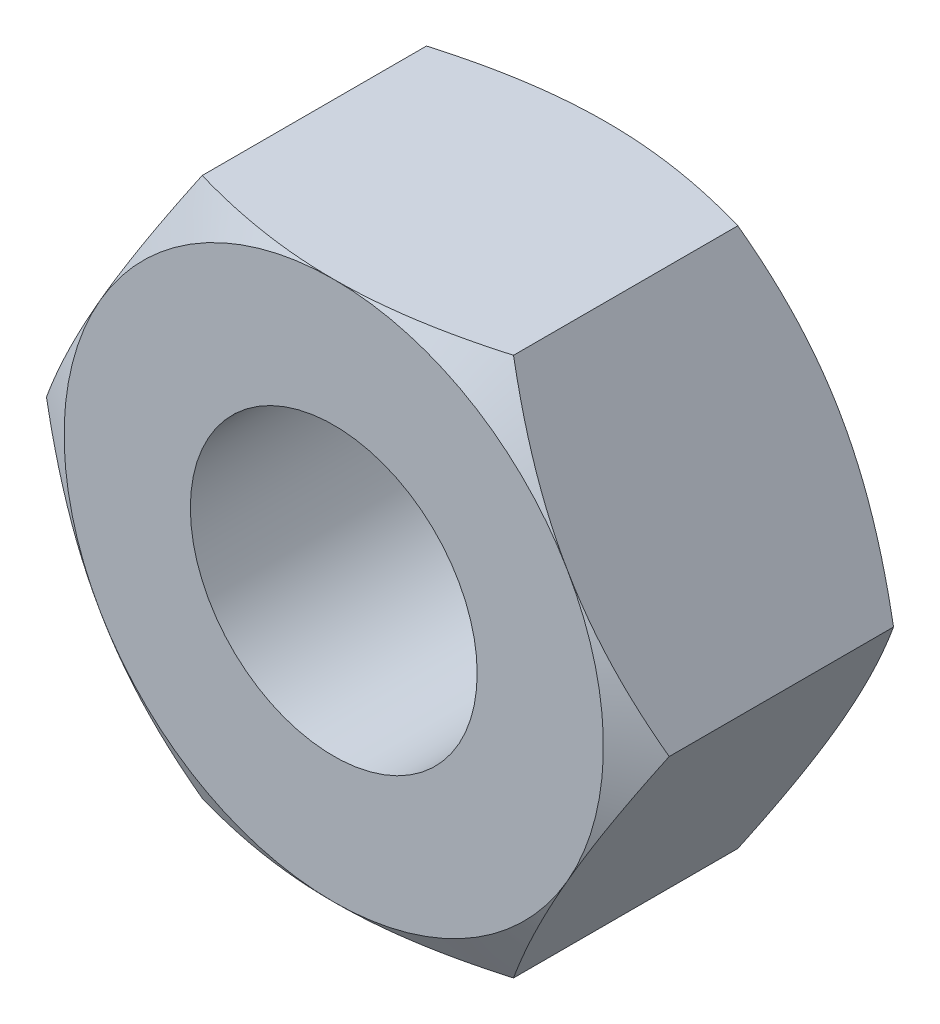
ISO-10303-21;
HEADER;
FILE_DESCRIPTION(('STEP AP214'),'2;1');
FILE_NAME('part.step','',(''),(''),'','','');
FILE_SCHEMA(('AUTOMOTIVE_DESIGN { 1 0 10303 214 1 1 1 1 }'));
ENDSEC;
DATA;
#1=APPLICATION_CONTEXT('core data for automotive mechanical design processes');
#2=APPLICATION_PROTOCOL_DEFINITION('international standard','automotive_design',2000,#1);
#3=PRODUCT_CONTEXT('',#1,'mechanical');
#4=PRODUCT('Part','Part','',(#3));
#5=PRODUCT_RELATED_PRODUCT_CATEGORY('part','',(#4));
#6=PRODUCT_DEFINITION_FORMATION('','',#4);
#7=PRODUCT_DEFINITION_CONTEXT('part definition',#1,'design');
#8=PRODUCT_DEFINITION('design','',#6,#7);
#9=PRODUCT_DEFINITION_SHAPE('','',#8);
#10=(LENGTH_UNIT() NAMED_UNIT(*) SI_UNIT(.MILLI.,.METRE.));
#11=(NAMED_UNIT(*) PLANE_ANGLE_UNIT() SI_UNIT($,.RADIAN.));
#12=(NAMED_UNIT(*) SI_UNIT($,.STERADIAN.) SOLID_ANGLE_UNIT());
#13=UNCERTAINTY_MEASURE_WITH_UNIT(LENGTH_MEASURE(1.E-05),#10,'distance_accuracy_value','');
#14=(GEOMETRIC_REPRESENTATION_CONTEXT(3) GLOBAL_UNCERTAINTY_ASSIGNED_CONTEXT((#13)) GLOBAL_UNIT_ASSIGNED_CONTEXT((#10,
#11,#12)) REPRESENTATION_CONTEXT('',''));
#15=CARTESIAN_POINT('',(0.,0.,0.));
#16=DIRECTION('',(0.,0.,1.));
#17=DIRECTION('',(1.,0.,0.));
#18=AXIS2_PLACEMENT_3D('',#15,#16,#17);
#19=CARTESIAN_POINT('',(0.,0.,-0.853596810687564));
#20=DIRECTION('',(0.,0.,-1.));
#21=DIRECTION('',(-1.,0.,0.));
#22=AXIS2_PLACEMENT_3D('',#19,#20,#21);
#23=CONICAL_SURFACE('',#22,10.9784730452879,1.0471975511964);
#24=CARTESIAN_POINT('',(-8.22724133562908,-4.75000000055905,-4.35169927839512E-13));
#25=CARTESIAN_POINT('',(-8.34364141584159,-4.5483891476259,3.88261547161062E-05));
#26=CARTESIAN_POINT('',(-8.46003588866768,-4.34678800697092,-0.00493960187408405));
#27=CARTESIAN_POINT('',(-8.69259629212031,-3.94398157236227,-0.0246423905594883));
#28=CARTESIAN_POINT('',(-8.80876226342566,-3.74277620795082,-0.0393648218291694));
#29=CARTESIAN_POINT('',(-9.0401153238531,-3.34206095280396,-0.0781700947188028));
#30=CARTESIAN_POINT('',(-9.15530440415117,-3.14254761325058,-0.102205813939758));
#31=CARTESIAN_POINT('',(-9.38513376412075,-2.74447148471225,-0.159120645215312));
#32=CARTESIAN_POINT('',(-9.49977402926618,-2.54590872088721,-0.19199999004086));
#33=CARTESIAN_POINT('',(-9.84239640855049,-1.95246935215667,-0.302887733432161));
#34=CARTESIAN_POINT('',(-10.0693831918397,-1.55931671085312,-0.393199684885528));
#35=CARTESIAN_POINT('',(-10.5214047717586,-0.776392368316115,-0.601482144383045));
#36=CARTESIAN_POINT('',(-10.7464238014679,-0.386647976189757,-0.719590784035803));
#37=CARTESIAN_POINT('',(-10.969655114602,-1.11143325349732E-12,-0.848505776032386));
#38=B_SPLINE_CURVE_WITH_KNOTS('',3,(#24,#25,#26,#27,#28,#29,#30,#31,#32,#33,#34,#35,#36,#37),
.UNSPECIFIED.,.F.,.F.,(4,2,2,2,2,2,4),(0.,0.698329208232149,1.39652018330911,2.09122370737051,
2.78594551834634,4.173568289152,5.56823794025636),.UNSPECIFIED.);
#39=CARTESIAN_POINT('',(-8.22724133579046,-4.75000000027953,-3.6097070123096E-13));
#40=VERTEX_POINT('',#39);
#41=CARTESIAN_POINT('',(-10.9696551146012,-8.78443786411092E-13,-0.848505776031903));
#42=VERTEX_POINT('',#41);
#43=EDGE_CURVE('E316',#40,#42,#38,.T.);
#44=ORIENTED_EDGE('',*,*,#43,.F.);
#45=CARTESIAN_POINT('',(0.,0.,-2.86771474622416E-13));
#46=DIRECTION('',(0.,0.,-1.));
#47=DIRECTION('',(-1.,0.,0.));
#48=AXIS2_PLACEMENT_3D('',#45,#46,#47);
#49=CIRCLE('',#48,9.49999999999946);
#50=CARTESIAN_POINT('',(-8.22724142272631,4.74999984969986,-4.19934956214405E-13));
#51=VERTEX_POINT('',#50);
#52=EDGE_CURVE('E152',#40,#51,#49,.T.);
#53=ORIENTED_EDGE('',*,*,#52,.T.);
#54=CARTESIAN_POINT('',(-10.9696551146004,-6.45071824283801E-13,-0.848505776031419));
#55=CARTESIAN_POINT('',(-10.7464238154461,0.386647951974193,-0.719590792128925));
#56=CARTESIAN_POINT('',(-10.5214047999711,0.776392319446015,-0.601482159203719));
#57=CARTESIAN_POINT('',(-10.0693832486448,1.55931661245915,-0.393199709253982));
#58=CARTESIAN_POINT('',(-9.84239647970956,1.95246922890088,-0.302887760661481));
#59=CARTESIAN_POINT('',(-9.49977412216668,2.54590855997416,-0.192000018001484));
#60=CARTESIAN_POINT('',(-9.38513386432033,2.74447131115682,-0.159120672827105));
#61=CARTESIAN_POINT('',(-9.15530451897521,3.14254741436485,-0.102205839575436));
#62=CARTESIAN_POINT('',(-9.04011544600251,3.34206074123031,-0.0781701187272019));
#63=CARTESIAN_POINT('',(-8.80876240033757,3.74277597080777,-0.0393648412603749));
#64=CARTESIAN_POINT('',(-8.69259643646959,3.94398132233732,-0.0246424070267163));
#65=CARTESIAN_POINT('',(-8.46003604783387,4.34678773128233,-0.00493961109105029));
#66=CARTESIAN_POINT('',(-8.34364158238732,4.54838885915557,3.8821224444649E-05));
#67=CARTESIAN_POINT('',(-8.2272415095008,4.74999969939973,9.0612996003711E-13));
#68=B_SPLINE_CURVE_WITH_KNOTS('',3,(#54,#55,#56,#57,#58,#59,#60,#61,#62,#63,#64,#65,#66,#67),
.UNSPECIFIED.,.F.,.F.,(4,2,2,2,2,2,4),(0.,1.39466956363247,2.78229224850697,3.47701401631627,
4.1717174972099,4.86990842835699,5.5682375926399),.UNSPECIFIED.);
#69=EDGE_CURVE('E158',#42,#51,#68,.T.);
#70=ORIENTED_EDGE('',*,*,#69,.F.);
#71=EDGE_LOOP('',(#44,#53,#70));
#72=FACE_BOUND('',#71,.T.);
#73=ADVANCED_FACE('F41',(#72),#23,.T.);
#74=CARTESIAN_POINT('',(0.,0.,-0.853596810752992));
#75=DIRECTION('',(0.,0.,-1.));
#76=DIRECTION('',(0.,1.,0.));
#77=AXIS2_PLACEMENT_3D('',#74,#75,#76);
#78=CONICAL_SURFACE('',#77,10.9784730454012,1.0471975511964);
#79=CARTESIAN_POINT('',(-8.2272415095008,4.74999969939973,9.0612778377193E-13));
#80=CARTESIAN_POINT('',(-8.11084142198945,4.95161056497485,3.88310693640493E-05));
#81=CARTESIAN_POINT('',(-7.99444694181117,5.15321171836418,-0.00493959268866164));
#82=CARTESIAN_POINT('',(-7.76188652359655,5.55601817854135,-0.024642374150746));
#83=CARTESIAN_POINT('',(-7.6457205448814,5.75722355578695,-0.0393648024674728));
#84=CARTESIAN_POINT('',(-7.41436746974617,6.15793883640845,-0.0781700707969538));
#85=CARTESIAN_POINT('',(-7.29917838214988,6.35745218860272,-0.1022057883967));
#86=CARTESIAN_POINT('',(-7.06934900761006,6.75552834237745,-0.159120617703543));
#87=CARTESIAN_POINT('',(-6.9547087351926,6.95409111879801,-0.191999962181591));
#88=CARTESIAN_POINT('',(-6.61208633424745,7.54753052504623,-0.302887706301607));
#89=CARTESIAN_POINT('',(-6.38509953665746,7.94068319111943,-0.393199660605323));
#90=CARTESIAN_POINT('',(-5.93307792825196,8.72360758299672,-0.6014821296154));
#91=CARTESIAN_POINT('',(-5.70805888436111,9.11335199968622,-0.719590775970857));
#92=CARTESIAN_POINT('',(-5.48482755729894,9.49999999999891,-0.848505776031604));
#93=B_SPLINE_CURVE_WITH_KNOTS('',3,(#79,#80,#81,#82,#83,#84,#85,#86,#87,#88,#89,#90,#91,#92),
.UNSPECIFIED.,.F.,.F.,(4,2,2,2,2,2,4),(0.,0.698329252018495,1.39652027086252,2.09122383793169,
2.78594569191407,4.17356854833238,5.56823828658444),.UNSPECIFIED.);
#94=CARTESIAN_POINT('',(-5.48482755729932,9.49999999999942,-0.848505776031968));
#95=VERTEX_POINT('',#94);
#96=EDGE_CURVE('E137',#51,#95,#93,.T.);
#97=ORIENTED_EDGE('',*,*,#96,.F.);
#98=CARTESIAN_POINT('',(0.,0.,-4.19911501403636E-13));
#99=DIRECTION('',(0.,0.,-1.));
#100=DIRECTION('',(0.,1.,0.));
#101=AXIS2_PLACEMENT_3D('',#98,#99,#100);
#102=CIRCLE('',#101,9.49999999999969);
#103=CARTESIAN_POINT('',(0.,9.49999999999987,-5.21512884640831E-13));
#104=VERTEX_POINT('',#103);
#105=EDGE_CURVE('E139',#51,#104,#102,.T.);
#106=ORIENTED_EDGE('',*,*,#105,.T.);
#107=CARTESIAN_POINT('',(-5.48482755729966,9.5,-0.848505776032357));
#108=CARTESIAN_POINT('',(-5.03836493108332,9.5,-0.719590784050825));
#109=CARTESIAN_POINT('',(-4.58832687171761,9.5,-0.601482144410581));
#110=CARTESIAN_POINT('',(-3.68428371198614,9.5,-0.393199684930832));
#111=CARTESIAN_POINT('',(-3.23031014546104,9.5,-0.302887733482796));
#112=CARTESIAN_POINT('',(-2.54506538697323,9.5,-0.191999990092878));
#113=CARTESIAN_POINT('',(-2.3157848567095,9.5,-0.159120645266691));
#114=CARTESIAN_POINT('',(-1.8561261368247,9.5,-0.102205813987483));
#115=CARTESIAN_POINT('',(-1.62574797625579,9.5,-0.0781700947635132));
#116=CARTESIAN_POINT('',(-1.16304185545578,9.5,-0.039364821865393));
#117=CARTESIAN_POINT('',(-0.930709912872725,9.5,-0.0246423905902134));
#118=CARTESIAN_POINT('',(-0.465589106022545,9.5,-0.00493960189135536));
#119=CARTESIAN_POINT('',(-0.23280016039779,9.5,3.88261454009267E-05));
#120=CARTESIAN_POINT('',(0.,9.5,-5.96174655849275E-13));
#121=B_SPLINE_CURVE_WITH_KNOTS('',3,(#107,#108,#109,#110,#111,#112,#113,#114,#115,#116,#117,
#118,#119,#120),.UNSPECIFIED.,.F.,.F.,(4,2,2,2,2,2,4),(0.,1.39466965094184,2.78229242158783,
3.47701423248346,4.17171775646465,4.86990873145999,5.56823793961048),.UNSPECIFIED.);
#122=EDGE_CURVE('E45',#95,#104,#121,.T.);
#123=ORIENTED_EDGE('',*,*,#122,.F.);
#124=EDGE_LOOP('',(#97,#106,#123));
#125=FACE_BOUND('',#124,.T.);
#126=ADVANCED_FACE('F135',(#125),#78,.T.);
#127=CARTESIAN_POINT('',(0.,0.,-0.853596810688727));
#128=DIRECTION('',(0.,0.,-1.));
#129=DIRECTION('',(0.,1.,0.));
#130=AXIS2_PLACEMENT_3D('',#127,#128,#129);
#131=CONICAL_SURFACE('',#130,10.9784730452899,1.0471975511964);
#132=CARTESIAN_POINT('',(0.,9.5,-5.96195917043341E-13));
#133=CARTESIAN_POINT('',(0.232800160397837,9.5,3.88261454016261E-05));
#134=CARTESIAN_POINT('',(0.465589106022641,9.5,-0.00493960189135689));
#135=CARTESIAN_POINT('',(0.930709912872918,9.5,-0.0246423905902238));
#136=CARTESIAN_POINT('',(1.16304185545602,9.5,-0.0393648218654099));
#137=CARTESIAN_POINT('',(1.62574797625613,9.5,-0.0781700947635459));
#138=CARTESIAN_POINT('',(1.85612613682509,9.5,-0.102205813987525));
#139=CARTESIAN_POINT('',(2.31578485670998,9.5,-0.159120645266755));
#140=CARTESIAN_POINT('',(2.54506538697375,9.5,-0.191999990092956));
#141=CARTESIAN_POINT('',(3.23031014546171,9.5,-0.302887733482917));
#142=CARTESIAN_POINT('',(3.6842837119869,9.5,-0.393199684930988));
#143=CARTESIAN_POINT('',(4.58832687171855,9.5,-0.601482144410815));
#144=CARTESIAN_POINT('',(5.03836493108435,9.5,-0.719590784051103));
#145=CARTESIAN_POINT('',(5.48482755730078,9.5,-0.848505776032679));
#146=B_SPLINE_CURVE_WITH_KNOTS('',3,(#132,#133,#134,#135,#136,#137,#138,#139,#140,#141,#142,
#143,#144,#145),.UNSPECIFIED.,.F.,.F.,(4,2,2,2,2,2,4),(0.,0.698329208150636,1.39652018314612,
2.09122370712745,2.78594551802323,4.17356828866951,5.56823793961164),.UNSPECIFIED.);
#147=CARTESIAN_POINT('',(5.48482755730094,9.4999999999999,-0.848505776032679));
#148=VERTEX_POINT('',#147);
#149=EDGE_CURVE('E142',#104,#148,#146,.T.);
#150=ORIENTED_EDGE('',*,*,#149,.F.);
#151=CARTESIAN_POINT('',(0.,0.,-4.46908135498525E-13));
#152=DIRECTION('',(0.,0.,-1.));
#153=DIRECTION('',(0.,1.,0.));
#154=AXIS2_PLACEMENT_3D('',#151,#152,#153);
#155=CIRCLE('',#154,9.49999999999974);
#156=CARTESIAN_POINT('',(8.22724133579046,4.75000000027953,-3.60851372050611E-13));
#157=VERTEX_POINT('',#156);
#158=EDGE_CURVE('E405',#104,#157,#155,.T.);
#159=ORIENTED_EDGE('',*,*,#158,.T.);
#160=CARTESIAN_POINT('',(5.48482755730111,9.4999999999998,-0.848505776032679));
#161=CARTESIAN_POINT('',(5.7080588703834,9.11335202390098,-0.719590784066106));
#162=CARTESIAN_POINT('',(5.9330779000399,8.72360763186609,-0.601482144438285));
#163=CARTESIAN_POINT('',(6.38509947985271,7.94068328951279,-0.393199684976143));
#164=CARTESIAN_POINT('',(6.61208626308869,7.54753064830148,-0.302887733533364));
#165=CARTESIAN_POINT('',(6.95470864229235,6.95409127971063,-0.191999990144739));
#166=CARTESIAN_POINT('',(7.0693489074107,6.75552851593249,-0.159120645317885));
#167=CARTESIAN_POINT('',(7.29917826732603,6.35745238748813,-0.102205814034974));
#168=CARTESIAN_POINT('',(7.41436734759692,6.15793904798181,-0.078170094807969));
#169=CARTESIAN_POINT('',(7.64572040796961,5.7572237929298,-0.039364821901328));
#170=CARTESIAN_POINT('',(7.76188637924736,5.55601842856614,-0.0246423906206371));
#171=CARTESIAN_POINT('',(7.99444678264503,5.15321199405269,-0.0049396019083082));
#172=CARTESIAN_POINT('',(8.11084125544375,4.95161085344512,3.88261364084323E-05));
#173=CARTESIAN_POINT('',(8.22724133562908,4.75000000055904,-4.34557466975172E-13));
#174=B_SPLINE_CURVE_WITH_KNOTS('',3,(#160,#161,#162,#163,#164,#165,#166,#167,#168,#169,#170,
#171,#172,#173),.UNSPECIFIED.,.F.,.F.,(4,2,2,2,2,2,4),(0.,1.39466965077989,2.78229242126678,
3.47701423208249,4.17171775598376,4.86990873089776,5.56823793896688),.UNSPECIFIED.);
#175=EDGE_CURVE('E197',#148,#157,#174,.T.);
#176=ORIENTED_EDGE('',*,*,#175,.F.);
#177=EDGE_LOOP('',(#150,#159,#176));
#178=FACE_BOUND('',#177,.T.);
#179=ADVANCED_FACE('F186',(#178),#131,.T.);
#180=CARTESIAN_POINT('',(0.,0.,-0.853596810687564));
#181=DIRECTION('',(0.,0.,-1.));
#182=DIRECTION('',(-1.,0.,0.));
#183=AXIS2_PLACEMENT_3D('',#180,#181,#182);
#184=CONICAL_SURFACE('',#183,10.9784730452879,1.0471975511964);
#185=CARTESIAN_POINT('',(8.22724133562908,4.75000000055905,-4.34931269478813E-13));
#186=CARTESIAN_POINT('',(8.34364141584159,4.5483891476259,3.88261547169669E-05));
#187=CARTESIAN_POINT('',(8.46003588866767,4.34678800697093,-0.00493960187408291));
#188=CARTESIAN_POINT('',(8.69259629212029,3.94398157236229,-0.0246423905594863));
#189=CARTESIAN_POINT('',(8.80876226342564,3.74277620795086,-0.0393648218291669));
#190=CARTESIAN_POINT('',(9.04011532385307,3.34206095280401,-0.0781700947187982));
#191=CARTESIAN_POINT('',(9.15530440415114,3.14254761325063,-0.102205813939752));
#192=CARTESIAN_POINT('',(9.38513376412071,2.74447148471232,-0.159120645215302));
#193=CARTESIAN_POINT('',(9.49977402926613,2.54590872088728,-0.191999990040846));
#194=CARTESIAN_POINT('',(9.84239640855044,1.95246935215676,-0.302887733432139));
#195=CARTESIAN_POINT('',(10.0693831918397,1.55931671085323,-0.393199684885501));
#196=CARTESIAN_POINT('',(10.5214047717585,0.776392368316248,-0.601482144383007));
#197=CARTESIAN_POINT('',(10.7464238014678,0.386647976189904,-0.719590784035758));
#198=CARTESIAN_POINT('',(10.969655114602,1.27333752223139E-12,-0.848505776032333));
#199=B_SPLINE_CURVE_WITH_KNOTS('',3,(#185,#186,#187,#188,#189,#190,#191,#192,#193,#194,#195,
#196,#197,#198),.UNSPECIFIED.,.F.,.F.,(4,2,2,2,2,2,4),(0.,0.698329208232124,1.39652018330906,
2.09122370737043,2.78594551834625,4.17356828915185,5.56823794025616),.UNSPECIFIED.);
#200=CARTESIAN_POINT('',(10.9696551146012,1.03954200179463E-12,-0.848505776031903));
#201=VERTEX_POINT('',#200);
#202=EDGE_CURVE('E403',#157,#201,#199,.T.);
#203=ORIENTED_EDGE('',*,*,#202,.F.);
#204=CARTESIAN_POINT('',(0.,0.,-2.86771474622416E-13));
#205=DIRECTION('',(0.,0.,-1.));
#206=DIRECTION('',(-1.,0.,0.));
#207=AXIS2_PLACEMENT_3D('',#204,#205,#206);
#208=CIRCLE('',#207,9.49999999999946);
#209=CARTESIAN_POINT('',(8.22724133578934,-4.75000000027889,-2.86705537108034E-13));
#210=VERTEX_POINT('',#209);
#211=EDGE_CURVE('E394',#157,#210,#208,.T.);
#212=ORIENTED_EDGE('',*,*,#211,.T.);
#213=CARTESIAN_POINT('',(10.9696551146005,8.06281182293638E-13,-0.848505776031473));
#214=CARTESIAN_POINT('',(10.7464238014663,-0.386647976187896,-0.719590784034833));
#215=CARTESIAN_POINT('',(10.5214047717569,-0.776392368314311,-0.601482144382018));
#216=CARTESIAN_POINT('',(10.069383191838,-1.55931671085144,-0.393199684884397));
#217=CARTESIAN_POINT('',(9.84239640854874,-1.95246935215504,-0.302887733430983));
#218=CARTESIAN_POINT('',(9.49977402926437,-2.54590872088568,-0.191999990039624));
#219=CARTESIAN_POINT('',(9.38513376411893,-2.74447148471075,-0.159120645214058));
#220=CARTESIAN_POINT('',(9.15530440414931,-3.14254761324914,-0.102205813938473));
#221=CARTESIAN_POINT('',(9.04011532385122,-3.34206095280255,-0.0781700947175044));
#222=CARTESIAN_POINT('',(8.80876226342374,-3.74277620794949,-0.0393648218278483));
#223=CARTESIAN_POINT('',(8.69259629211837,-3.94398157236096,-0.0246423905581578));
#224=CARTESIAN_POINT('',(8.4600358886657,-4.34678800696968,-0.0049396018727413));
#225=CARTESIAN_POINT('',(8.34364141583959,-4.54838914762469,3.8826156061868E-05));
#226=CARTESIAN_POINT('',(8.22724133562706,-4.75000000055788,9.09340811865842E-13));
#227=B_SPLINE_CURVE_WITH_KNOTS('',3,(#213,#214,#215,#216,#217,#218,#219,#220,#221,#222,#223,
#224,#225,#226),.UNSPECIFIED.,.F.,.F.,(4,2,2,2,2,2,4),(0.,1.3946696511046,2.78229242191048,
3.47701423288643,4.17171775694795,4.86990873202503,5.5682379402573),.UNSPECIFIED.);
#228=EDGE_CURVE('E363',#201,#210,#227,.T.);
#229=ORIENTED_EDGE('',*,*,#228,.F.);
#230=EDGE_LOOP('',(#203,#212,#229));
#231=FACE_BOUND('',#230,.T.);
#232=ADVANCED_FACE('F191',(#231),#184,.T.);
#233=CARTESIAN_POINT('',(0.,0.,-0.853596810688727));
#234=DIRECTION('',(0.,0.,-1.));
#235=DIRECTION('',(0.,1.,0.));
#236=AXIS2_PLACEMENT_3D('',#233,#234,#235);
#237=CONICAL_SURFACE('',#236,10.9784730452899,1.0471975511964);
#238=CARTESIAN_POINT('',(8.22724133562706,-4.75000000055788,9.09901372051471E-13));
#239=CARTESIAN_POINT('',(8.11084125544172,-4.95161085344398,3.88261377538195E-05));
#240=CARTESIAN_POINT('',(7.99444678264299,-5.15321199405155,-0.00493960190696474));
#241=CARTESIAN_POINT('',(7.76188637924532,-5.55601842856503,-0.0246423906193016));
#242=CARTESIAN_POINT('',(7.64572040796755,-5.7572237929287,-0.0393648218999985));
#243=CARTESIAN_POINT('',(7.41436734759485,-6.15793904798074,-0.078170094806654));
#244=CARTESIAN_POINT('',(7.29917826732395,-6.35745238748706,-0.102205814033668));
#245=CARTESIAN_POINT('',(7.06934890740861,-6.75552851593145,-0.159120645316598));
#246=CARTESIAN_POINT('',(6.95470864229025,-6.9540912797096,-0.191999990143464));
#247=CARTESIAN_POINT('',(6.61208626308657,-7.54753064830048,-0.302887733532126));
#248=CARTESIAN_POINT('',(6.38509947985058,-7.94068328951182,-0.393199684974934));
#249=CARTESIAN_POINT('',(5.93307790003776,-8.72360763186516,-0.60148214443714));
#250=CARTESIAN_POINT('',(5.70805887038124,-9.11335202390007,-0.719590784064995));
#251=CARTESIAN_POINT('',(5.48482755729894,-9.49999999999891,-0.848505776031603));
#252=B_SPLINE_CURVE_WITH_KNOTS('',3,(#238,#239,#240,#241,#242,#243,#244,#245,#246,#247,#248,
#249,#250,#251),.UNSPECIFIED.,.F.,.F.,(4,2,2,2,2,2,4),(0.,0.698329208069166,1.39652018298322,
2.09122370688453,2.78594551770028,4.17356828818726,5.56823793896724),.UNSPECIFIED.);
#253=CARTESIAN_POINT('',(5.48482755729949,-9.49999999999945,-0.848505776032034));
#254=VERTEX_POINT('',#253);
#255=EDGE_CURVE('E355',#210,#254,#252,.T.);
#256=ORIENTED_EDGE('',*,*,#255,.F.);
#257=CARTESIAN_POINT('',(0.,0.,-2.86663054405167E-13));
#258=DIRECTION('',(0.,0.,-1.));
#259=DIRECTION('',(0.,1.,0.));
#260=AXIS2_PLACEMENT_3D('',#257,#258,#259);
#261=CIRCLE('',#260,9.49999999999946);
#262=CARTESIAN_POINT('',(0.,-9.49999999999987,-3.66738685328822E-13));
#263=VERTEX_POINT('',#262);
#264=EDGE_CURVE('E385',#210,#263,#261,.T.);
#265=ORIENTED_EDGE('',*,*,#264,.T.);
#266=CARTESIAN_POINT('',(5.48482755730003,-9.5,-0.848505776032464));
#267=CARTESIAN_POINT('',(5.03836493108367,-9.5,-0.719590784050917));
#268=CARTESIAN_POINT('',(4.58832687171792,-9.5,-0.601482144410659));
#269=CARTESIAN_POINT('',(3.68428371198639,-9.5,-0.393199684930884));
#270=CARTESIAN_POINT('',(3.23031014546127,-9.5,-0.302887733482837));
#271=CARTESIAN_POINT('',(2.5450653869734,-9.5,-0.191999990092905));
#272=CARTESIAN_POINT('',(2.31578485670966,-9.5,-0.159120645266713));
#273=CARTESIAN_POINT('',(1.85612613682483,-9.5,-0.102205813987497));
#274=CARTESIAN_POINT('',(1.6257479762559,-9.5,-0.0781700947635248));
#275=CARTESIAN_POINT('',(1.16304185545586,-9.5,-0.0393648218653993));
#276=CARTESIAN_POINT('',(0.930709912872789,-9.5,-0.0246423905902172));
#277=CARTESIAN_POINT('',(0.465589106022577,-9.5,-0.00493960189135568));
#278=CARTESIAN_POINT('',(0.232800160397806,-9.5,3.88261454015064E-05));
#279=CARTESIAN_POINT('',(0.,-9.5,-5.96149880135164E-13));
#280=B_SPLINE_CURVE_WITH_KNOTS('',3,(#266,#267,#268,#269,#270,#271,#272,#273,#274,#275,#276,
#277,#278,#279),.UNSPECIFIED.,.F.,.F.,(4,2,2,2,2,2,4),(0.,1.39466965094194,2.78229242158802,
3.4770142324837,4.17171775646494,4.86990873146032,5.56823793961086),.UNSPECIFIED.);
#281=EDGE_CURVE('E347',#254,#263,#280,.T.);
#282=ORIENTED_EDGE('',*,*,#281,.F.);
#283=EDGE_LOOP('',(#256,#265,#282));
#284=FACE_BOUND('',#283,.T.);
#285=ADVANCED_FACE('F371',(#284),#237,.T.);
#286=CARTESIAN_POINT('',(0.,0.,-0.853596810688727));
#287=DIRECTION('',(0.,0.,-1.));
#288=DIRECTION('',(0.,1.,0.));
#289=AXIS2_PLACEMENT_3D('',#286,#287,#288);
#290=CONICAL_SURFACE('',#289,10.9784730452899,1.0471975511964);
#291=CARTESIAN_POINT('',(0.,-9.5,-5.96130052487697E-13));
#292=CARTESIAN_POINT('',(-0.232800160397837,-9.5,3.88261454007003E-05));
#293=CARTESIAN_POINT('',(-0.465589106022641,-9.5,-0.00493960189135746));
#294=CARTESIAN_POINT('',(-0.930709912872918,-9.5,-0.0246423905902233));
#295=CARTESIAN_POINT('',(-1.16304185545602,-9.5,-0.0393648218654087));
#296=CARTESIAN_POINT('',(-1.62574797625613,-9.5,-0.0781700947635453));
#297=CARTESIAN_POINT('',(-1.85612613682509,-9.5,-0.102205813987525));
#298=CARTESIAN_POINT('',(-2.31578485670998,-9.5,-0.159120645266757));
#299=CARTESIAN_POINT('',(-2.54506538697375,-9.5,-0.191999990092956));
#300=CARTESIAN_POINT('',(-3.23031014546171,-9.5,-0.302887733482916));
#301=CARTESIAN_POINT('',(-3.6842837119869,-9.5,-0.393199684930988));
#302=CARTESIAN_POINT('',(-4.58832687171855,-9.5,-0.601482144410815));
#303=CARTESIAN_POINT('',(-5.03836493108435,-9.5,-0.719590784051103));
#304=CARTESIAN_POINT('',(-5.48482755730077,-9.5,-0.848505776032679));
#305=B_SPLINE_CURVE_WITH_KNOTS('',3,(#291,#292,#293,#294,#295,#296,#297,#298,#299,#300,#301,
#302,#303,#304),.UNSPECIFIED.,.F.,.F.,(4,2,2,2,2,2,4),(0.,0.698329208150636,1.39652018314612,
2.09122370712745,2.78594551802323,4.17356828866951,5.56823793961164),.UNSPECIFIED.);
#306=CARTESIAN_POINT('',(-5.48482755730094,-9.4999999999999,-0.848505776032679));
#307=VERTEX_POINT('',#306);
#308=EDGE_CURVE('E339',#263,#307,#305,.T.);
#309=ORIENTED_EDGE('',*,*,#308,.F.);
#310=CARTESIAN_POINT('',(0.,0.,-4.46908135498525E-13));
#311=DIRECTION('',(0.,0.,-1.));
#312=DIRECTION('',(0.,1.,0.));
#313=AXIS2_PLACEMENT_3D('',#310,#311,#312);
#314=CIRCLE('',#313,9.49999999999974);
#315=EDGE_CURVE('E398',#263,#40,#314,.T.);
#316=ORIENTED_EDGE('',*,*,#315,.T.);
#317=CARTESIAN_POINT('',(-5.48482755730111,-9.4999999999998,-0.848505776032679));
#318=CARTESIAN_POINT('',(-5.7080588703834,-9.11335202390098,-0.719590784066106));
#319=CARTESIAN_POINT('',(-5.9330779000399,-8.72360763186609,-0.601482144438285));
#320=CARTESIAN_POINT('',(-6.38509947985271,-7.9406832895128,-0.393199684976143));
#321=CARTESIAN_POINT('',(-6.61208626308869,-7.54753064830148,-0.302887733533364));
#322=CARTESIAN_POINT('',(-6.95470864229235,-6.95409127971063,-0.191999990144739));
#323=CARTESIAN_POINT('',(-7.0693489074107,-6.75552851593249,-0.159120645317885));
#324=CARTESIAN_POINT('',(-7.29917826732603,-6.35745238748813,-0.102205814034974));
#325=CARTESIAN_POINT('',(-7.41436734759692,-6.15793904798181,-0.0781700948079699));
#326=CARTESIAN_POINT('',(-7.6457204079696,-5.7572237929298,-0.0393648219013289));
#327=CARTESIAN_POINT('',(-7.76188637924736,-5.55601842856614,-0.0246423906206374));
#328=CARTESIAN_POINT('',(-7.99444678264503,-5.15321199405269,-0.0049396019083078));
#329=CARTESIAN_POINT('',(-8.11084125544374,-4.95161085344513,3.88261364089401E-05));
#330=CARTESIAN_POINT('',(-8.22724133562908,-4.75000000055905,-4.35091440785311E-13));
#331=B_SPLINE_CURVE_WITH_KNOTS('',3,(#317,#318,#319,#320,#321,#322,#323,#324,#325,#326,#327,
#328,#329,#330),.UNSPECIFIED.,.F.,.F.,(4,2,2,2,2,2,4),(0.,1.39466965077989,2.78229242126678,
3.47701423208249,4.17171775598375,4.86990873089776,5.56823793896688),.UNSPECIFIED.);
#332=EDGE_CURVE('E322',#307,#40,#331,.T.);
#333=ORIENTED_EDGE('',*,*,#332,.F.);
#334=EDGE_LOOP('',(#309,#316,#333));
#335=FACE_BOUND('',#334,.T.);
#336=ADVANCED_FACE('F216',(#335),#290,.T.);
#337=CARTESIAN_POINT('',(-5.484827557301,9.5,0.));
#338=DIRECTION('',(0.,1.,0.));
#339=DIRECTION('',(0.,0.,1.));
#340=AXIS2_PLACEMENT_3D('',#337,#338,#339);
#341=PLANE('',#340);
#342=DIRECTION('',(0.,0.,1.));
#343=VECTOR('',#342,1.);
#344=CARTESIAN_POINT('',(5.484827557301,9.5,0.));
#345=LINE('',#344,#343);
#346=CARTESIAN_POINT('',(5.48482754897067,9.50000001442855,-8.75149421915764));
#347=VERTEX_POINT('',#346);
#348=EDGE_CURVE('E209',#347,#148,#345,.T.);
#349=ORIENTED_EDGE('',*,*,#348,.F.);
#350=CARTESIAN_POINT('',(0.,9.5,-9.59999999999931));
#351=CARTESIAN_POINT('',(0.232800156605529,9.5,-9.60003882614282));
#352=CARTESIAN_POINT('',(0.465589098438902,9.5,-9.59506039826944));
#353=CARTESIAN_POINT('',(0.930709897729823,9.5,-9.57535761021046));
#354=CARTESIAN_POINT('',(1.16304183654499,9.5,-9.56063517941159));
#355=CARTESIAN_POINT('',(1.62574794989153,9.5,-9.52182990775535));
#356=CARTESIAN_POINT('',(1.85612610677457,9.5,-9.49779418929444));
#357=CARTESIAN_POINT('',(2.31578481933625,9.5,-9.44087935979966));
#358=CARTESIAN_POINT('',(2.54506534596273,9.5,-9.40800001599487));
#359=CARTESIAN_POINT('',(3.23031009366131,9.5,-9.29711227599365));
#360=CARTESIAN_POINT('',(3.68428365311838,9.5,-9.20680032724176));
#361=CARTESIAN_POINT('',(4.58832679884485,9.5,-8.99851787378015));
#362=CARTESIAN_POINT('',(5.03836485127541,9.5,-8.88040923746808));
#363=CARTESIAN_POINT('',(5.48482747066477,9.5,-8.75149424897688));
#364=B_SPLINE_CURVE_WITH_KNOTS('',3,(#350,#351,#352,#353,#354,#355,#356,#357,#358,#359,#360,
#361,#362,#363),.UNSPECIFIED.,.F.,.F.,(4,2,2,2,2,2,4),(0.,0.698329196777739,1.39652016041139,
2.0912236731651,2.78594547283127,4.17356822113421,5.56823784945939),.UNSPECIFIED.);
#365=CARTESIAN_POINT('',(0.,9.49999999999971,-9.59999999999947));
#366=VERTEX_POINT('',#365);
#367=EDGE_CURVE('E223',#366,#347,#364,.T.);
#368=ORIENTED_EDGE('',*,*,#367,.F.);
#369=CARTESIAN_POINT('',(-5.48482758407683,9.49999996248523,-8.7514941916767));
#370=CARTESIAN_POINT('',(-5.0383649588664,9.49999998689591,-8.8804091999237));
#371=CARTESIAN_POINT('',(-4.58832689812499,9.49999999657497,-8.99851784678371));
#372=CARTESIAN_POINT('',(-3.68428373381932,9.50000000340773,-9.20680031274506));
#373=CARTESIAN_POINT('',(-3.23031016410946,9.50000000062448,-9.29711226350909));
#374=CARTESIAN_POINT('',(-2.54506540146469,9.49999999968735,-9.40800000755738));
#375=CARTESIAN_POINT('',(-2.31578487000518,9.49999999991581,-9.4408793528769));
#376=CARTESIAN_POINT('',(-1.85612614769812,9.50000000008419,-9.49779418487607));
#377=CARTESIAN_POINT('',(-1.62574798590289,9.50000000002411,-9.52182990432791));
#378=CARTESIAN_POINT('',(-1.16304186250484,9.49999999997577,-9.56063517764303));
#379=CARTESIAN_POINT('',(-0.93070991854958,9.49999999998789,-9.57535760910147));
#380=CARTESIAN_POINT('',(-0.465589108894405,9.50000000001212,-9.59506039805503));
#381=CARTESIAN_POINT('',(-0.232800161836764,9.50000000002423,-9.60003882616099));
#382=CARTESIAN_POINT('',(0.,9.5,-9.5999999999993));
#383=B_SPLINE_CURVE_WITH_KNOTS('',3,(#369,#370,#371,#372,#373,#374,#375,#376,#377,#378,#379,
#380,#381,#382),.UNSPECIFIED.,.F.,.F.,(4,2,2,2,2,2,4),(0.,1.39466966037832,2.7822924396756,
3.47701425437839,4.17171778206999,4.86990876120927,5.56823797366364),.UNSPECIFIED.);
#384=CARTESIAN_POINT('',(-5.48482757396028,9.49999999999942,-8.75149421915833));
#385=VERTEX_POINT('',#384);
#386=EDGE_CURVE('E148',#385,#366,#383,.T.);
#387=ORIENTED_EDGE('',*,*,#386,.F.);
#388=DIRECTION('',(0.,0.,1.));
#389=VECTOR('',#388,1.);
#390=CARTESIAN_POINT('',(-5.48482755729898,9.49999999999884,0.));
#391=LINE('',#390,#389);
#392=EDGE_CURVE('E145',#95,#385,#391,.F.);
#393=ORIENTED_EDGE('',*,*,#392,.F.);
#394=ORIENTED_EDGE('',*,*,#122,.T.);
#395=ORIENTED_EDGE('',*,*,#149,.T.);
#396=EDGE_LOOP('',(#349,#368,#387,#393,#394,#395));
#397=FACE_BOUND('',#396,.T.);
#398=ADVANCED_FACE('F146',(#397),#341,.T.);
#399=CARTESIAN_POINT('',(5.484827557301,9.5,0.));
#400=DIRECTION('',(0.866025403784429,0.500000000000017,0.));
#401=DIRECTION('',(-0.500000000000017,0.866025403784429,0.));
#402=AXIS2_PLACEMENT_3D('',#399,#400,#401);
#403=PLANE('',#402);
#404=DIRECTION('',(0.,0.,1.));
#405=VECTOR('',#404,1.);
#406=CARTESIAN_POINT('',(10.9696551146,0.,0.));
#407=LINE('',#406,#405);
#408=CARTESIAN_POINT('',(10.9696551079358,-1.15426792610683E-08,-8.75149422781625));
#409=VERTEX_POINT('',#408);
#410=EDGE_CURVE('E408',#409,#201,#407,.T.);
#411=ORIENTED_EDGE('',*,*,#410,.F.);
#412=CARTESIAN_POINT('',(8.22724133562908,4.75000000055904,-9.59999999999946));
#413=CARTESIAN_POINT('',(8.34364141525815,4.54838914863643,-9.60003882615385));
#414=CARTESIAN_POINT('',(8.46003588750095,4.34678800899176,-9.59506039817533));
#415=CARTESIAN_POINT('',(8.69259628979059,3.94398157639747,-9.57535760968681));
#416=CARTESIAN_POINT('',(8.80876226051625,3.74277621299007,-9.56063517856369));
#417=CARTESIAN_POINT('',(9.04011531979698,3.34206095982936,-9.52182990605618));
#418=CARTESIAN_POINT('',(9.15530439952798,3.14254762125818,-9.49779418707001));
#419=CARTESIAN_POINT('',(9.38513375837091,2.74447149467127,-9.44087935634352));
#420=CARTESIAN_POINT('',(9.49977402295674,2.54590873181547,-9.40800001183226));
#421=CARTESIAN_POINT('',(9.84239640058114,1.95246936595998,-9.29711226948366));
#422=CARTESIAN_POINT('',(10.069383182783,1.55931672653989,-9.20680031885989));
#423=CARTESIAN_POINT('',(10.5214047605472,0.776392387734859,-8.99851786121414));
#424=CARTESIAN_POINT('',(10.7464237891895,0.386647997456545,-8.88040922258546));
#425=CARTESIAN_POINT('',(10.9696551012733,2.30871138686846E-08,-8.75149423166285));
#426=B_SPLINE_CURVE_WITH_KNOTS('',3,(#412,#413,#414,#415,#416,#417,#418,#419,#420,#421,#422,
#423,#424,#425),.UNSPECIFIED.,.F.,.F.,(4,2,2,2,2,2,4),(0.,0.69832920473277,1.39652017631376,
2.09122369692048,2.78594550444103,4.17356826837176,5.56823791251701),.UNSPECIFIED.);
#427=CARTESIAN_POINT('',(8.22724133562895,4.75000000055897,-9.59999999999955));
#428=VERTEX_POINT('',#427);
#429=EDGE_CURVE('E473',#428,#409,#426,.T.);
#430=ORIENTED_EDGE('',*,*,#429,.F.);
#431=CARTESIAN_POINT('',(5.48482751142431,9.5000000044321,-8.75149419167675));
#432=CARTESIAN_POINT('',(5.70805884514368,9.1133520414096,-8.88040919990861));
#433=CARTESIAN_POINT('',(5.93307788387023,8.72360765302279,-8.99851784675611));
#434=CARTESIAN_POINT('',(6.38509947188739,7.94068331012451,-9.20680031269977));
#435=CARTESIAN_POINT('',(6.61208625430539,7.54753066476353,-9.29711226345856));
#436=CARTESIAN_POINT('',(6.95470863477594,6.95409129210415,-9.40800000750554));
#437=CARTESIAN_POINT('',(7.06934890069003,6.75552852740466,-9.44087935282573));
#438=CARTESIAN_POINT('',(7.29917826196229,6.35745239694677,-9.4977941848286));
#439=CARTESIAN_POINT('',(7.4143673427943,6.15793905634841,-9.52182990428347));
#440=CARTESIAN_POINT('',(7.64572040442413,5.75722379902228,-9.5606351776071));
#441=CARTESIAN_POINT('',(7.76188637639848,5.55601843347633,-9.57535760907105));
#442=CARTESIAN_POINT('',(7.99444678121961,5.15321199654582,-9.59506039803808));
#443=CARTESIAN_POINT('',(8.11084125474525,4.95161085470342,-9.600038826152));
#444=CARTESIAN_POINT('',(8.22724133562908,4.75000000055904,-9.59999999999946));
#445=B_SPLINE_CURVE_WITH_KNOTS('',3,(#431,#432,#433,#434,#435,#436,#437,#438,#439,#440,#441,
#442,#443,#444),.UNSPECIFIED.,.F.,.F.,(4,2,2,2,2,2,4),(0.,1.39466966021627,2.78229243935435,
3.47701425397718,4.17171778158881,4.86990876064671,5.56823797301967),.UNSPECIFIED.);
#446=EDGE_CURVE('E480',#347,#428,#445,.T.);
#447=ORIENTED_EDGE('',*,*,#446,.F.);
#448=ORIENTED_EDGE('',*,*,#348,.T.);
#449=ORIENTED_EDGE('',*,*,#175,.T.);
#450=ORIENTED_EDGE('',*,*,#202,.T.);
#451=EDGE_LOOP('',(#411,#430,#447,#448,#449,#450));
#452=FACE_BOUND('',#451,.T.);
#453=ADVANCED_FACE('F215',(#452),#403,.T.);
#454=CARTESIAN_POINT('',(10.9696551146,0.,0.));
#455=DIRECTION('',(0.866025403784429,-0.500000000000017,0.));
#456=DIRECTION('',(0.500000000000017,0.866025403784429,0.));
#457=AXIS2_PLACEMENT_3D('',#454,#455,#456);
#458=PLANE('',#457);
#459=DIRECTION('',(0.,0.,-1.));
#460=VECTOR('',#459,1.);
#461=CARTESIAN_POINT('',(5.484827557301,-9.5,0.));
#462=LINE('',#461,#460);
#463=CARTESIAN_POINT('',(5.48482757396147,-9.5,-8.75149421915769));
#464=VERTEX_POINT('',#463);
#465=EDGE_CURVE('E362',#464,#254,#462,.F.);
#466=ORIENTED_EDGE('',*,*,#465,.F.);
#467=CARTESIAN_POINT('',(8.22724133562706,-4.75000000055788,-9.60000000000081));
#468=CARTESIAN_POINT('',(8.11084125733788,-4.95161085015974,-9.60003882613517));
#469=CARTESIAN_POINT('',(7.99444678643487,-5.15321198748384,-9.59506039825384));
#470=CARTESIAN_POINT('',(7.76188638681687,-5.55601841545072,-9.57535761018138));
#471=CARTESIAN_POINT('',(7.64572041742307,-5.75722377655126,-9.560635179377));
#472=CARTESIAN_POINT('',(7.41436736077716,-6.15793902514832,-9.52182990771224));
#473=CARTESIAN_POINT('',(7.29917828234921,-6.35745236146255,-9.49779418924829));
#474=CARTESIAN_POINT('',(7.06934892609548,-6.75552848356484,-9.44087935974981));
#475=CARTESIAN_POINT('',(6.95470866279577,-6.95409124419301,-9.40800001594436));
#476=CARTESIAN_POINT('',(6.61208628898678,-7.54753060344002,-9.29711227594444));
#477=CARTESIAN_POINT('',(6.38509950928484,-7.94068323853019,-9.20680032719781));
#478=CARTESIAN_POINT('',(5.93307793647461,-8.72360756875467,-8.99851787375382));
#479=CARTESIAN_POINT('',(5.70805891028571,-9.11335195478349,-8.88040923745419));
#480=CARTESIAN_POINT('',(5.48482760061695,-9.49999992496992,-8.75149424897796));
#481=B_SPLINE_CURVE_WITH_KNOTS('',3,(#467,#468,#469,#470,#471,#472,#473,#474,#475,#476,#477,
#478,#479,#480),.UNSPECIFIED.,.F.,.F.,(4,2,2,2,2,2,4),(0.,0.698329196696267,1.39652016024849,
2.09122367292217,2.78594547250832,4.17356822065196,5.56823784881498),.UNSPECIFIED.);
#482=CARTESIAN_POINT('',(8.22724133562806,-4.75000000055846,-9.60000000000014));
#483=VERTEX_POINT('',#482);
#484=EDGE_CURVE('E447',#483,#464,#481,.T.);
#485=ORIENTED_EDGE('',*,*,#484,.F.);
#486=CARTESIAN_POINT('',(10.9696551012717,-2.30853585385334E-08,-8.75149423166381));
#487=CARTESIAN_POINT('',(10.7464237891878,-0.386647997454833,-8.88040922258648));
#488=CARTESIAN_POINT('',(10.5214047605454,-0.776392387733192,-8.99851786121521));
#489=CARTESIAN_POINT('',(10.0693831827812,-1.55931672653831,-9.20680031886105));
#490=CARTESIAN_POINT('',(9.84239640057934,-1.95246936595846,-9.29711226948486));
#491=CARTESIAN_POINT('',(9.4997740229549,-2.54590873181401,-9.40800001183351));
#492=CARTESIAN_POINT('',(9.38513375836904,-2.74447149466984,-9.44087935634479));
#493=CARTESIAN_POINT('',(9.15530439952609,-3.1425476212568,-9.49779418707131));
#494=CARTESIAN_POINT('',(9.04011531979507,-3.34206095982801,-9.52182990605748));
#495=CARTESIAN_POINT('',(8.80876226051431,-3.74277621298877,-9.56063517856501));
#496=CARTESIAN_POINT('',(8.69259628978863,-3.94398157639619,-9.57535760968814));
#497=CARTESIAN_POINT('',(8.46003588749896,-4.34678800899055,-9.59506039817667));
#498=CARTESIAN_POINT('',(8.34364141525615,-4.54838914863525,-9.6000388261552));
#499=CARTESIAN_POINT('',(8.22724133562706,-4.75000000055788,-9.60000000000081));
#500=B_SPLINE_CURVE_WITH_KNOTS('',3,(#486,#487,#488,#489,#490,#491,#492,#493,#494,#495,#496,
#497,#498,#499),.UNSPECIFIED.,.F.,.F.,(4,2,2,2,2,2,4),(0.,1.39466964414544,2.78229240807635,
3.47701421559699,4.1717177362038,4.86990870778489,5.56823791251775),.UNSPECIFIED.);
#501=EDGE_CURVE('E468',#409,#483,#500,.T.);
#502=ORIENTED_EDGE('',*,*,#501,.F.);
#503=ORIENTED_EDGE('',*,*,#410,.T.);
#504=ORIENTED_EDGE('',*,*,#228,.T.);
#505=ORIENTED_EDGE('',*,*,#255,.T.);
#506=EDGE_LOOP('',(#466,#485,#502,#503,#504,#505));
#507=FACE_BOUND('',#506,.T.);
#508=ADVANCED_FACE('F369',(#507),#458,.T.);
#509=CARTESIAN_POINT('',(5.484827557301,-9.5,0.));
#510=DIRECTION('',(0.,-1.,0.));
#511=DIRECTION('',(0.,0.,-1.));
#512=AXIS2_PLACEMENT_3D('',#509,#510,#511);
#513=PLANE('',#512);
#514=DIRECTION('',(0.,0.,1.));
#515=VECTOR('',#514,1.);
#516=CARTESIAN_POINT('',(-5.484827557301,-9.5,0.));
#517=LINE('',#516,#515);
#518=CARTESIAN_POINT('',(-5.48482754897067,-9.50000001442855,-8.75149421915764));
#519=VERTEX_POINT('',#518);
#520=EDGE_CURVE('E346',#519,#307,#517,.T.);
#521=ORIENTED_EDGE('',*,*,#520,.F.);
#522=CARTESIAN_POINT('',(0.,-9.5,-9.5999999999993));
#523=CARTESIAN_POINT('',(-0.232800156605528,-9.5,-9.60003882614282));
#524=CARTESIAN_POINT('',(-0.465589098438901,-9.5,-9.59506039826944));
#525=CARTESIAN_POINT('',(-0.930709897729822,-9.5,-9.57535761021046));
#526=CARTESIAN_POINT('',(-1.16304183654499,-9.5,-9.56063517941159));
#527=CARTESIAN_POINT('',(-1.62574794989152,-9.5,-9.52182990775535));
#528=CARTESIAN_POINT('',(-1.85612610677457,-9.5,-9.49779418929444));
#529=CARTESIAN_POINT('',(-2.31578481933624,-9.5,-9.44087935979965));
#530=CARTESIAN_POINT('',(-2.54506534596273,-9.5,-9.40800001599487));
#531=CARTESIAN_POINT('',(-3.2303100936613,-9.5,-9.29711227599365));
#532=CARTESIAN_POINT('',(-3.68428365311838,-9.5,-9.20680032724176));
#533=CARTESIAN_POINT('',(-4.58832679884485,-9.5,-8.99851787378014));
#534=CARTESIAN_POINT('',(-5.03836485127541,-9.5,-8.88040923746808));
#535=CARTESIAN_POINT('',(-5.48482747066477,-9.5,-8.75149424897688));
#536=B_SPLINE_CURVE_WITH_KNOTS('',3,(#522,#523,#524,#525,#526,#527,#528,#529,#530,#531,#532,
#533,#534,#535),.UNSPECIFIED.,.F.,.F.,(4,2,2,2,2,2,4),(0.,0.698329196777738,1.39652016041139,
2.0912236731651,2.78594547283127,4.17356822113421,5.56823784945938),.UNSPECIFIED.);
#537=CARTESIAN_POINT('',(0.,-9.49999999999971,-9.59999999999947));
#538=VERTEX_POINT('',#537);
#539=EDGE_CURVE('E446',#538,#519,#536,.T.);
#540=ORIENTED_EDGE('',*,*,#539,.F.);
#541=CARTESIAN_POINT('',(5.48482758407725,-9.49999996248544,-8.75149419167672));
#542=CARTESIAN_POINT('',(5.03836495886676,-9.49999998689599,-8.88040919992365));
#543=CARTESIAN_POINT('',(4.58832689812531,-9.49999999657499,-8.99851784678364));
#544=CARTESIAN_POINT('',(3.68428373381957,-9.50000000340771,-9.20680031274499));
#545=CARTESIAN_POINT('',(3.23031016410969,-9.50000000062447,-9.29711226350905));
#546=CARTESIAN_POINT('',(2.54506540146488,-9.49999999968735,-9.40800000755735));
#547=CARTESIAN_POINT('',(2.31578487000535,-9.49999999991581,-9.44087935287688));
#548=CARTESIAN_POINT('',(1.85612614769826,-9.50000000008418,-9.49779418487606));
#549=CARTESIAN_POINT('',(1.62574798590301,-9.5000000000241,-9.5218299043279));
#550=CARTESIAN_POINT('',(1.16304186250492,-9.49999999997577,-9.56063517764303));
#551=CARTESIAN_POINT('',(0.930709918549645,-9.49999999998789,-9.57535760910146));
#552=CARTESIAN_POINT('',(0.465589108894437,-9.50000000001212,-9.59506039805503));
#553=CARTESIAN_POINT('',(0.23280016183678,-9.50000000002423,-9.60003882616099));
#554=CARTESIAN_POINT('',(0.,-9.5,-9.5999999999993));
#555=B_SPLINE_CURVE_WITH_KNOTS('',3,(#541,#542,#543,#544,#545,#546,#547,#548,#549,#550,#551,
#552,#553,#554),.UNSPECIFIED.,.F.,.F.,(4,2,2,2,2,2,4),(0.,1.39466966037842,2.78229243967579,
3.47701425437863,4.17171778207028,4.86990876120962,5.56823797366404),.UNSPECIFIED.);
#556=EDGE_CURVE('E438',#464,#538,#555,.T.);
#557=ORIENTED_EDGE('',*,*,#556,.F.);
#558=ORIENTED_EDGE('',*,*,#465,.T.);
#559=ORIENTED_EDGE('',*,*,#281,.T.);
#560=ORIENTED_EDGE('',*,*,#308,.T.);
#561=EDGE_LOOP('',(#521,#540,#557,#558,#559,#560));
#562=FACE_BOUND('',#561,.T.);
#563=ADVANCED_FACE('F310',(#562),#513,.T.);
#564=CARTESIAN_POINT('',(-5.484827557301,-9.5,0.));
#565=DIRECTION('',(-0.866025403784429,-0.500000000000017,0.));
#566=DIRECTION('',(0.500000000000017,-0.866025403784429,0.));
#567=AXIS2_PLACEMENT_3D('',#564,#565,#566);
#568=PLANE('',#567);
#569=DIRECTION('',(0.,0.,1.));
#570=VECTOR('',#569,1.);
#571=CARTESIAN_POINT('',(-10.9696551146,0.,0.));
#572=LINE('',#571,#570);
#573=CARTESIAN_POINT('',(-10.9696551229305,-1.44288921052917E-08,-8.75149421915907));
#574=VERTEX_POINT('',#573);
#575=EDGE_CURVE('E163',#574,#42,#572,.T.);
#576=ORIENTED_EDGE('',*,*,#575,.F.);
#577=CARTESIAN_POINT('',(-8.22724133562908,-4.75000000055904,-9.59999999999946));
#578=CARTESIAN_POINT('',(-8.34364141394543,-4.54838915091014,-9.60003882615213));
#579=CARTESIAN_POINT('',(-8.4600358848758,-4.34678801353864,-9.59506039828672));
#580=CARTESIAN_POINT('',(-8.69259628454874,-3.9439815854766,-9.5753576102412));
#581=CARTESIAN_POINT('',(-8.80876225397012,-3.74277622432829,-9.56063517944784));
#582=CARTESIAN_POINT('',(-9.04011531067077,-3.34206097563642,-9.5218299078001));
#583=CARTESIAN_POINT('',(-9.15530438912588,-3.14254763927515,-9.49779418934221));
#584=CARTESIAN_POINT('',(-9.38513374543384,-2.74447151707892,-9.44087935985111));
#585=CARTESIAN_POINT('',(-9.49977400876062,-2.54590875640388,-9.40800001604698));
#586=CARTESIAN_POINT('',(-9.84239638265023,-1.95246939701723,-9.29711227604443));
#587=CARTESIAN_POINT('',(-10.0693831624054,-1.55931676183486,-9.20680032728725));
#588=CARTESIAN_POINT('',(-10.5214047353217,-0.776392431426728,-8.99851787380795));
#589=CARTESIAN_POINT('',(-10.7464237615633,-0.386648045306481,-8.88040923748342));
#590=CARTESIAN_POINT('',(-10.969655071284,-7.50302567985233E-08,-8.75149424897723));
#591=B_SPLINE_CURVE_WITH_KNOTS('',3,(#577,#578,#579,#580,#581,#582,#583,#584,#585,#586,#587,
#588,#589,#590),.UNSPECIFIED.,.F.,.F.,(4,2,2,2,2,2,4),(0.,0.698329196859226,1.39652016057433,
2.09122367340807,2.78594547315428,4.17356822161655,5.56823785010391),.UNSPECIFIED.);
#592=CARTESIAN_POINT('',(-8.22724133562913,-4.75000000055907,-9.59999999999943));
#593=VERTEX_POINT('',#592);
#594=EDGE_CURVE('E66',#593,#574,#591,.T.);
#595=ORIENTED_EDGE('',*,*,#594,.F.);
#596=CARTESIAN_POINT('',(-5.4848275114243,-9.5000000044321,-8.75149419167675));
#597=CARTESIAN_POINT('',(-5.70805884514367,-9.1133520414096,-8.88040919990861));
#598=CARTESIAN_POINT('',(-5.93307788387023,-8.72360765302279,-8.99851784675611));
#599=CARTESIAN_POINT('',(-6.38509947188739,-7.94068331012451,-9.20680031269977));
#600=CARTESIAN_POINT('',(-6.61208625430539,-7.54753066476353,-9.29711226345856));
#601=CARTESIAN_POINT('',(-6.95470863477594,-6.95409129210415,-9.40800000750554));
#602=CARTESIAN_POINT('',(-7.06934890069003,-6.75552852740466,-9.44087935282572));
#603=CARTESIAN_POINT('',(-7.29917826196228,-6.35745239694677,-9.49779418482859));
#604=CARTESIAN_POINT('',(-7.4143673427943,-6.15793905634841,-9.52182990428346));
#605=CARTESIAN_POINT('',(-7.64572040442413,-5.75722379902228,-9.5606351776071));
#606=CARTESIAN_POINT('',(-7.76188637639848,-5.55601843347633,-9.57535760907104));
#607=CARTESIAN_POINT('',(-7.99444678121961,-5.15321199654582,-9.59506039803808));
#608=CARTESIAN_POINT('',(-8.11084125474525,-4.95161085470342,-9.600038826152));
#609=CARTESIAN_POINT('',(-8.22724133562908,-4.75000000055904,-9.59999999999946));
#610=B_SPLINE_CURVE_WITH_KNOTS('',3,(#596,#597,#598,#599,#600,#601,#602,#603,#604,#605,#606,
#607,#608,#609),.UNSPECIFIED.,.F.,.F.,(4,2,2,2,2,2,4),(0.,1.39466966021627,2.78229243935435,
3.47701425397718,4.17171778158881,4.86990876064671,5.56823797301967),.UNSPECIFIED.);
#611=EDGE_CURVE('E299',#519,#593,#610,.T.);
#612=ORIENTED_EDGE('',*,*,#611,.F.);
#613=ORIENTED_EDGE('',*,*,#520,.T.);
#614=ORIENTED_EDGE('',*,*,#332,.T.);
#615=ORIENTED_EDGE('',*,*,#43,.T.);
#616=EDGE_LOOP('',(#576,#595,#612,#613,#614,#615));
#617=FACE_BOUND('',#616,.T.);
#618=ADVANCED_FACE('F260',(#617),#568,.T.);
#619=CARTESIAN_POINT('',(-10.9696551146,0.,0.));
#620=DIRECTION('',(-0.866025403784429,0.500000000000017,0.));
#621=DIRECTION('',(-0.500000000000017,-0.866025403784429,0.));
#622=AXIS2_PLACEMENT_3D('',#619,#620,#621);
#623=PLANE('',#622);
#624=ORIENTED_EDGE('',*,*,#392,.T.);
#625=CARTESIAN_POINT('',(-8.22724133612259,4.74999999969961,-9.60000000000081));
#626=CARTESIAN_POINT('',(-8.11084125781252,4.95161084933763,-9.60003882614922));
#627=CARTESIAN_POINT('',(-7.99444678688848,5.15321198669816,-9.59506039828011));
#628=CARTESIAN_POINT('',(-7.76188638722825,5.55601841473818,-9.57535761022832));
#629=CARTESIAN_POINT('',(-7.64572041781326,5.75722377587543,-9.56063517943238));
#630=CARTESIAN_POINT('',(-7.41436736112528,6.15793902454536,-9.52182990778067));
#631=CARTESIAN_POINT('',(-7.29917828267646,6.35745236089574,-9.49779418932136));
#632=CARTESIAN_POINT('',(-7.06934892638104,6.75552848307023,-9.44087935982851));
#633=CARTESIAN_POINT('',(-6.95470866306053,6.95409124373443,-9.40800001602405));
#634=CARTESIAN_POINT('',(-6.61208628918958,7.54753060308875,-9.29711227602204));
#635=CARTESIAN_POINT('',(-6.38509950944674,7.94068323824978,-9.20680032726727));
#636=CARTESIAN_POINT('',(-5.93307793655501,8.7236075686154,-8.99851787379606));
#637=CARTESIAN_POINT('',(-5.70805891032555,9.11335195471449,-8.88040923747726));
#638=CARTESIAN_POINT('',(-5.48482760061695,9.49999992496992,-8.75149424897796));
#639=B_SPLINE_CURVE_WITH_KNOTS('',3,(#625,#626,#627,#628,#629,#630,#631,#632,#633,#634,#635,
#636,#637,#638),.UNSPECIFIED.,.F.,.F.,(4,2,2,2,2,2,4),(0.,0.698329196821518,1.39652016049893,
2.09122367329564,2.78594547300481,4.17356822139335,5.56823784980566),.UNSPECIFIED.);
#640=CARTESIAN_POINT('',(-8.2272413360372,4.74999999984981,-9.59999999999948));
#641=VERTEX_POINT('',#640);
#642=EDGE_CURVE('E238',#641,#385,#639,.T.);
#643=ORIENTED_EDGE('',*,*,#642,.F.);
#644=CARTESIAN_POINT('',(-10.969655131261,-2.88577841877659E-08,-8.75149421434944));
#645=CARTESIAN_POINT('',(-10.7464238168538,0.386647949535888,-8.88040920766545));
#646=CARTESIAN_POINT('',(-10.5214047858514,0.776392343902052,-8.99851784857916));
#647=CARTESIAN_POINT('',(-10.0693832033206,1.55931669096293,-9.20680031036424));
#648=CARTESIAN_POINT('',(-9.84239641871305,1.95246933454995,-9.29711226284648));
#649=CARTESIAN_POINT('',(-9.49977403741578,2.54590870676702,-9.4080000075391));
#650=CARTESIAN_POINT('',(-9.38513377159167,2.74447147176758,-9.44087935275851));
#651=CARTESIAN_POINT('',(-9.15530441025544,3.14254760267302,-9.49779418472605));
#652=CARTESIAN_POINT('',(-9.0401153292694,3.34206094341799,-9.52182990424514));
#653=CARTESIAN_POINT('',(-8.80876226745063,3.74277620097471,-9.56063517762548));
#654=CARTESIAN_POINT('',(-8.69259629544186,3.94398156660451,-9.57535760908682));
#655=CARTESIAN_POINT('',(-8.46003589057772,4.34678800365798,-9.595060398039));
#656=CARTESIAN_POINT('',(-8.34364141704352,4.54838914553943,-9.60003882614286));
#657=CARTESIAN_POINT('',(-8.22724133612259,4.74999999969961,-9.60000000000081));
#658=B_SPLINE_CURVE_WITH_KNOTS('',3,(#644,#645,#646,#647,#648,#649,#650,#651,#652,#653,#654,
#655,#656,#657),.UNSPECIFIED.,.F.,.F.,(4,2,2,2,2,2,4),(0.,1.39466965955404,2.78229243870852,
3.47701425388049,4.17171778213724,4.86990876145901,5.56823797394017),.UNSPECIFIED.);
#659=EDGE_CURVE('E286',#574,#641,#658,.T.);
#660=ORIENTED_EDGE('',*,*,#659,.F.);
#661=ORIENTED_EDGE('',*,*,#575,.T.);
#662=ORIENTED_EDGE('',*,*,#69,.T.);
#663=ORIENTED_EDGE('',*,*,#96,.T.);
#664=EDGE_LOOP('',(#624,#643,#660,#661,#662,#663));
#665=FACE_BOUND('',#664,.T.);
#666=ADVANCED_FACE('F155',(#665),#623,.T.);
#667=CARTESIAN_POINT('',(0.,0.,0.));
#668=DIRECTION('',(0.,0.,-1.));
#669=DIRECTION('',(-1.,0.,0.));
#670=AXIS2_PLACEMENT_3D('',#667,#668,#669);
#671=PLANE('',#670);
#672=CARTESIAN_POINT('',(0.,0.,0.));
#673=DIRECTION('',(0.,0.,1.));
#674=DIRECTION('',(1.,0.,0.));
#675=AXIS2_PLACEMENT_3D('',#672,#673,#674);
#676=CIRCLE('',#675,5.05281250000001);
#677=CARTESIAN_POINT('',(5.05281250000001,0.,0.));
#678=VERTEX_POINT('',#677);
#679=EDGE_CURVE('E791',#678,#678,#676,.T.);
#680=ORIENTED_EDGE('',*,*,#679,.F.);
#681=EDGE_LOOP('',(#680));
#682=FACE_BOUND('',#681,.T.);
#683=ORIENTED_EDGE('',*,*,#264,.F.);
#684=ORIENTED_EDGE('',*,*,#211,.F.);
#685=ORIENTED_EDGE('',*,*,#158,.F.);
#686=ORIENTED_EDGE('',*,*,#105,.F.);
#687=ORIENTED_EDGE('',*,*,#52,.F.);
#688=ORIENTED_EDGE('',*,*,#315,.F.);
#689=EDGE_LOOP('',(#683,#684,#685,#686,#687,#688));
#690=FACE_BOUND('',#689,.T.);
#691=ADVANCED_FACE('F250',(#682,#690),#671,.F.);
#692=CARTESIAN_POINT('',(0.,0.,-8.74640318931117));
#693=DIRECTION('',(0.,0.,1.));
#694=DIRECTION('',(1.,0.,0.));
#695=AXIS2_PLACEMENT_3D('',#692,#693,#694);
#696=CONICAL_SURFACE('',#695,10.9784730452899,1.0471975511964);
#697=ORIENTED_EDGE('',*,*,#386,.T.);
#698=CARTESIAN_POINT('',(0.,0.,-9.59999999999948));
#699=DIRECTION('',(0.,0.,1.));
#700=DIRECTION('',(1.,0.,0.));
#701=AXIS2_PLACEMENT_3D('',#698,#699,#700);
#702=CIRCLE('',#701,9.4999999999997);
#703=EDGE_CURVE('E541',#641,#366,#702,.F.);
#704=ORIENTED_EDGE('',*,*,#703,.F.);
#705=ORIENTED_EDGE('',*,*,#642,.T.);
#706=EDGE_LOOP('',(#697,#704,#705));
#707=FACE_BOUND('',#706,.T.);
#708=ADVANCED_FACE('F246',(#707),#696,.T.);
#709=CARTESIAN_POINT('',(0.,0.,-8.74640318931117));
#710=DIRECTION('',(0.,0.,1.));
#711=DIRECTION('',(0.,-1.,0.));
#712=AXIS2_PLACEMENT_3D('',#709,#710,#711);
#713=CONICAL_SURFACE('',#712,10.9784730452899,1.0471975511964);
#714=ORIENTED_EDGE('',*,*,#446,.T.);
#715=CARTESIAN_POINT('',(0.,0.,-9.59999999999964));
#716=DIRECTION('',(0.,0.,1.));
#717=DIRECTION('',(0.,-1.,0.));
#718=AXIS2_PLACEMENT_3D('',#715,#716,#717);
#719=CIRCLE('',#718,9.49999999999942);
#720=EDGE_CURVE('E544',#366,#428,#719,.F.);
#721=ORIENTED_EDGE('',*,*,#720,.F.);
#722=ORIENTED_EDGE('',*,*,#367,.T.);
#723=EDGE_LOOP('',(#714,#721,#722));
#724=FACE_BOUND('',#723,.T.);
#725=ADVANCED_FACE('F249',(#724),#713,.T.);
#726=CARTESIAN_POINT('',(0.,0.,-8.74640318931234));
#727=DIRECTION('',(0.,0.,1.));
#728=DIRECTION('',(1.,0.,0.));
#729=AXIS2_PLACEMENT_3D('',#726,#727,#728);
#730=CONICAL_SURFACE('',#729,10.9784730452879,1.0471975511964);
#731=ORIENTED_EDGE('',*,*,#429,.T.);
#732=ORIENTED_EDGE('',*,*,#501,.T.);
#733=CARTESIAN_POINT('',(0.,0.,-9.59999999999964));
#734=DIRECTION('',(0.,0.,1.));
#735=DIRECTION('',(1.,0.,0.));
#736=AXIS2_PLACEMENT_3D('',#733,#734,#735);
#737=CIRCLE('',#736,9.49999999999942);
#738=EDGE_CURVE('E548',#428,#483,#737,.F.);
#739=ORIENTED_EDGE('',*,*,#738,.F.);
#740=EDGE_LOOP('',(#731,#732,#739));
#741=FACE_BOUND('',#740,.T.);
#742=ADVANCED_FACE('F461',(#741),#730,.T.);
#743=CARTESIAN_POINT('',(0.,0.,-8.74640318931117));
#744=DIRECTION('',(0.,0.,1.));
#745=DIRECTION('',(0.,-1.,0.));
#746=AXIS2_PLACEMENT_3D('',#743,#744,#745);
#747=CONICAL_SURFACE('',#746,10.9784730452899,1.0471975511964);
#748=ORIENTED_EDGE('',*,*,#556,.T.);
#749=CARTESIAN_POINT('',(0.,0.,-9.59999999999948));
#750=DIRECTION('',(0.,0.,1.));
#751=DIRECTION('',(0.,-1.,0.));
#752=AXIS2_PLACEMENT_3D('',#749,#750,#751);
#753=CIRCLE('',#752,9.4999999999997);
#754=EDGE_CURVE('E558',#483,#538,#753,.F.);
#755=ORIENTED_EDGE('',*,*,#754,.F.);
#756=ORIENTED_EDGE('',*,*,#484,.T.);
#757=EDGE_LOOP('',(#748,#755,#756));
#758=FACE_BOUND('',#757,.T.);
#759=ADVANCED_FACE('F458',(#758),#747,.T.);
#760=CARTESIAN_POINT('',(0.,0.,-8.74640318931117));
#761=DIRECTION('',(0.,0.,1.));
#762=DIRECTION('',(0.,-1.,0.));
#763=AXIS2_PLACEMENT_3D('',#760,#761,#762);
#764=CONICAL_SURFACE('',#763,10.9784730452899,1.0471975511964);
#765=ORIENTED_EDGE('',*,*,#611,.T.);
#766=CARTESIAN_POINT('',(0.,0.,-9.59999999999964));
#767=DIRECTION('',(0.,0.,1.));
#768=DIRECTION('',(0.,-1.,0.));
#769=AXIS2_PLACEMENT_3D('',#766,#767,#768);
#770=CIRCLE('',#769,9.49999999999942);
#771=EDGE_CURVE('E57',#538,#593,#770,.F.);
#772=ORIENTED_EDGE('',*,*,#771,.F.);
#773=ORIENTED_EDGE('',*,*,#539,.T.);
#774=EDGE_LOOP('',(#765,#772,#773));
#775=FACE_BOUND('',#774,.T.);
#776=ADVANCED_FACE('F275',(#775),#764,.T.);
#777=CARTESIAN_POINT('',(0.,0.,-8.74640318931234));
#778=DIRECTION('',(0.,0.,1.));
#779=DIRECTION('',(1.,0.,0.));
#780=AXIS2_PLACEMENT_3D('',#777,#778,#779);
#781=CONICAL_SURFACE('',#780,10.9784730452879,1.0471975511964);
#782=ORIENTED_EDGE('',*,*,#594,.T.);
#783=ORIENTED_EDGE('',*,*,#659,.T.);
#784=CARTESIAN_POINT('',(0.,0.,-9.5999999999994));
#785=DIRECTION('',(0.,0.,1.));
#786=DIRECTION('',(1.,0.,0.));
#787=AXIS2_PLACEMENT_3D('',#784,#785,#786);
#788=CIRCLE('',#787,9.49999999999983);
#789=EDGE_CURVE('E12',#593,#641,#788,.F.);
#790=ORIENTED_EDGE('',*,*,#789,.F.);
#791=EDGE_LOOP('',(#782,#783,#790));
#792=FACE_BOUND('',#791,.T.);
#793=ADVANCED_FACE('F266',(#792),#781,.T.);
#794=CARTESIAN_POINT('',(0.,0.,-9.6));
#795=DIRECTION('',(0.,0.,-1.));
#796=DIRECTION('',(-1.,0.,0.));
#797=AXIS2_PLACEMENT_3D('',#794,#795,#796);
#798=PLANE('',#797);
#799=CARTESIAN_POINT('',(0.,0.,-9.6000000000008));
#800=DIRECTION('',(0.,0.,1.));
#801=DIRECTION('',(1.,0.,0.));
#802=AXIS2_PLACEMENT_3D('',#799,#800,#801);
#803=CIRCLE('',#802,5.05281250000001);
#804=CARTESIAN_POINT('',(5.05281250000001,0.,-9.6000000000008));
#805=VERTEX_POINT('',#804);
#806=EDGE_CURVE('E143',#805,#805,#803,.T.);
#807=ORIENTED_EDGE('',*,*,#806,.T.);
#808=EDGE_LOOP('',(#807));
#809=FACE_BOUND('',#808,.T.);
#810=ORIENTED_EDGE('',*,*,#771,.T.);
#811=ORIENTED_EDGE('',*,*,#789,.T.);
#812=ORIENTED_EDGE('',*,*,#703,.T.);
#813=ORIENTED_EDGE('',*,*,#720,.T.);
#814=ORIENTED_EDGE('',*,*,#738,.T.);
#815=ORIENTED_EDGE('',*,*,#754,.T.);
#816=EDGE_LOOP('',(#810,#811,#812,#813,#814,#815));
#817=FACE_BOUND('',#816,.T.);
#818=ADVANCED_FACE('F263',(#809,#817),#798,.T.);
#819=CARTESIAN_POINT('',(0.,0.,0.));
#820=DIRECTION('',(0.,0.,1.));
#821=DIRECTION('',(1.,0.,0.));
#822=AXIS2_PLACEMENT_3D('',#819,#820,#821);
#823=CYLINDRICAL_SURFACE('',#822,5.05281250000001);
#824=ORIENTED_EDGE('',*,*,#806,.F.);
#825=EDGE_LOOP('',(#824));
#826=FACE_BOUND('',#825,.T.);
#827=ORIENTED_EDGE('',*,*,#679,.T.);
#828=EDGE_LOOP('',(#827));
#829=FACE_BOUND('',#828,.T.);
#830=ADVANCED_FACE('F265',(#826,#829),#823,.F.);
#831=CLOSED_SHELL('',(#73,#126,#179,#232,#285,#336,#398,#453,#508,#563,#618,#666,#691,#708,#725,
#742,#759,#776,#793,#818,#830));
#832=MANIFOLD_SOLID_BREP('B2',#831);
#833=ADVANCED_BREP_SHAPE_REPRESENTATION('',(#18,#832),#14);
#834=SHAPE_DEFINITION_REPRESENTATION(#9,#833);
ENDSEC;
END-ISO-10303-21;
